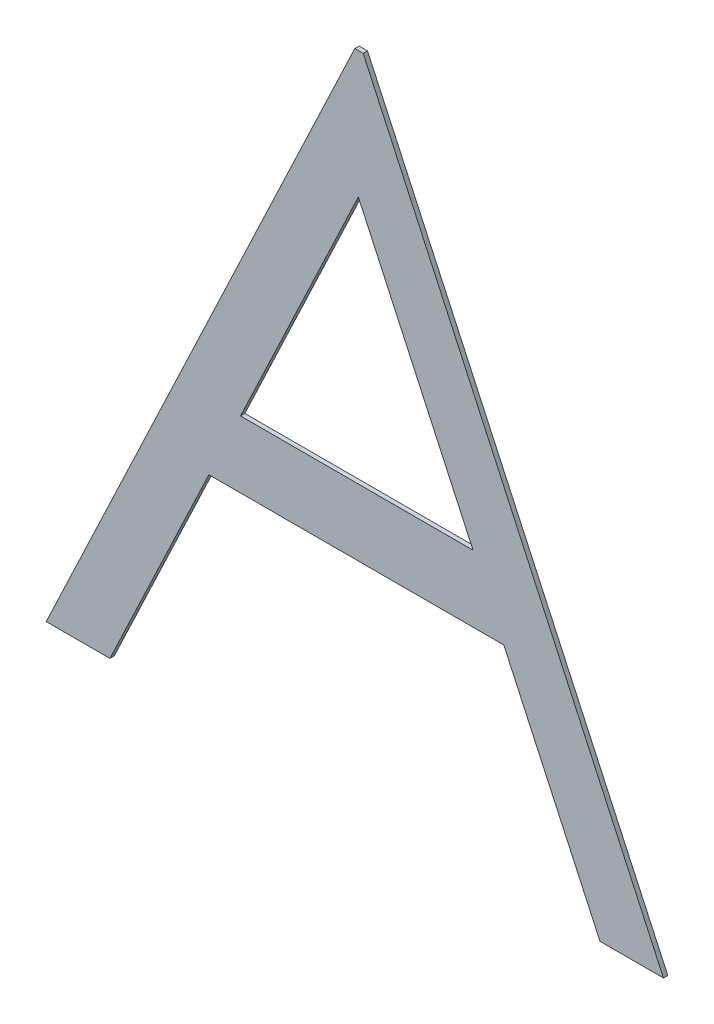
ISO-10303-21;
HEADER;
FILE_DESCRIPTION(('STEP AP214'),'2;1');
FILE_NAME('part.step','',(''),(''),'','','');
FILE_SCHEMA(('AUTOMOTIVE_DESIGN { 1 0 10303 214 1 1 1 1 }'));
ENDSEC;
DATA;
#1=APPLICATION_CONTEXT('core data for automotive mechanical design processes');
#2=APPLICATION_PROTOCOL_DEFINITION('international standard','automotive_design',2000,#1);
#3=PRODUCT_CONTEXT('',#1,'mechanical');
#4=PRODUCT('Part','Part','',(#3));
#5=PRODUCT_RELATED_PRODUCT_CATEGORY('part','',(#4));
#6=PRODUCT_DEFINITION_FORMATION('','',#4);
#7=PRODUCT_DEFINITION_CONTEXT('part definition',#1,'design');
#8=PRODUCT_DEFINITION('design','',#6,#7);
#9=PRODUCT_DEFINITION_SHAPE('','',#8);
#10=(LENGTH_UNIT() NAMED_UNIT(*) SI_UNIT(.MILLI.,.METRE.));
#11=(NAMED_UNIT(*) PLANE_ANGLE_UNIT() SI_UNIT($,.RADIAN.));
#12=(NAMED_UNIT(*) SI_UNIT($,.STERADIAN.) SOLID_ANGLE_UNIT());
#13=UNCERTAINTY_MEASURE_WITH_UNIT(LENGTH_MEASURE(1.E-05),#10,'distance_accuracy_value','');
#14=(GEOMETRIC_REPRESENTATION_CONTEXT(3) GLOBAL_UNCERTAINTY_ASSIGNED_CONTEXT((#13)) GLOBAL_UNIT_ASSIGNED_CONTEXT((#10,
#11,#12)) REPRESENTATION_CONTEXT('',''));
#15=CARTESIAN_POINT('',(0.,0.,0.));
#16=DIRECTION('',(0.,0.,1.));
#17=DIRECTION('',(1.,0.,0.));
#18=AXIS2_PLACEMENT_3D('',#15,#16,#17);
#19=CARTESIAN_POINT('',(0.,0.,0.));
#20=DIRECTION('',(0.,0.,1.));
#21=DIRECTION('',(1.,0.,0.));
#22=AXIS2_PLACEMENT_3D('',#19,#20,#21);
#23=PLANE('',#22);
#24=DIRECTION('',(0.428351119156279,0.903612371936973,0.));
#25=VECTOR('',#24,1.);
#26=CARTESIAN_POINT('',(0.136262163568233,14.4030755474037,0.));
#27=LINE('',#26,#25);
#28=CARTESIAN_POINT('',(-3.31349745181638,7.12576184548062,0.));
#29=VERTEX_POINT('',#28);
#30=CARTESIAN_POINT('',(0.136262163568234,14.4030755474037,0.));
#31=VERTEX_POINT('',#30);
#32=EDGE_CURVE('E151',#29,#31,#27,.T.);
#33=ORIENTED_EDGE('',*,*,#32,.F.);
#34=DIRECTION('',(1.,0.,0.));
#35=VECTOR('',#34,1.);
#36=CARTESIAN_POINT('',(-3.31349745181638,7.12576184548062,0.));
#37=LINE('',#36,#35);
#38=CARTESIAN_POINT('',(3.49443524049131,7.12576184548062,0.));
#39=VERTEX_POINT('',#38);
#40=EDGE_CURVE('E159',#39,#29,#37,.F.);
#41=ORIENTED_EDGE('',*,*,#40,.F.);
#42=DIRECTION('',(0.418997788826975,-0.907987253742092,0.));
#43=VECTOR('',#42,1.);
#44=CARTESIAN_POINT('',(3.49443524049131,7.12576184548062,0.));
#45=LINE('',#44,#43);
#46=EDGE_CURVE('E154',#31,#39,#45,.T.);
#47=ORIENTED_EDGE('',*,*,#46,.F.);
#48=EDGE_LOOP('',(#33,#41,#47));
#49=FACE_BOUND('',#48,.T.);
#50=DIRECTION('',(-0.419058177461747,0.907959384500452,0.));
#51=VECTOR('',#50,1.);
#52=CARTESIAN_POINT('',(0.277458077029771,18.1161464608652,0.));
#53=LINE('',#52,#51);
#54=CARTESIAN_POINT('',(9.06976576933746,-0.933853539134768,0.));
#55=VERTEX_POINT('',#54);
#56=CARTESIAN_POINT('',(0.277458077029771,18.1161464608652,0.));
#57=VERTEX_POINT('',#56);
#58=EDGE_CURVE('E145',#55,#57,#53,.T.);
#59=ORIENTED_EDGE('',*,*,#58,.F.);
#60=DIRECTION('',(1.,0.,0.));
#61=VECTOR('',#60,1.);
#62=CARTESIAN_POINT('',(9.06976576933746,-0.933853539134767,0.));
#63=LINE('',#62,#61);
#64=CARTESIAN_POINT('',(7.21132225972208,-0.933853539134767,0.));
#65=VERTEX_POINT('',#64);
#66=EDGE_CURVE('E139',#65,#55,#63,.T.);
#67=ORIENTED_EDGE('',*,*,#66,.F.);
#68=DIRECTION('',(0.418842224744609,-0.908059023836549,0.));
#69=VECTOR('',#68,1.);
#70=CARTESIAN_POINT('',(7.21132225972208,-0.933853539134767,0.));
#71=LINE('',#70,#69);
#72=CARTESIAN_POINT('',(4.39503620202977,5.17191569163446,0.));
#73=VERTEX_POINT('',#72);
#74=EDGE_CURVE('E133',#73,#65,#71,.T.);
#75=ORIENTED_EDGE('',*,*,#74,.F.);
#76=DIRECTION('',(1.,0.,0.));
#77=VECTOR('',#76,1.);
#78=CARTESIAN_POINT('',(4.39503620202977,5.17191569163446,0.));
#79=LINE('',#78,#77);
#80=CARTESIAN_POINT('',(-4.24081115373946,5.17191569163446,0.));
#81=VERTEX_POINT('',#80);
#82=EDGE_CURVE('E127',#81,#73,#79,.T.);
#83=ORIENTED_EDGE('',*,*,#82,.F.);
#84=DIRECTION('',(0.428596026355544,0.903496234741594,0.));
#85=VECTOR('',#84,1.);
#86=CARTESIAN_POINT('',(-4.24081115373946,5.17191569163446,0.));
#87=LINE('',#86,#85);
#88=CARTESIAN_POINT('',(-7.13723543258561,-0.933853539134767,0.));
#89=VERTEX_POINT('',#88);
#90=EDGE_CURVE('E121',#89,#81,#87,.T.);
#91=ORIENTED_EDGE('',*,*,#90,.F.);
#92=DIRECTION('',(1.,0.,0.));
#93=VECTOR('',#92,1.);
#94=CARTESIAN_POINT('',(-7.13723543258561,-0.933853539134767,0.));
#95=LINE('',#94,#93);
#96=CARTESIAN_POINT('',(-9.00331115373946,-0.933853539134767,0.));
#97=VERTEX_POINT('',#96);
#98=EDGE_CURVE('E97',#97,#89,#95,.T.);
#99=ORIENTED_EDGE('',*,*,#98,.F.);
#100=DIRECTION('',(-0.428584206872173,-0.903501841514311,0.));
#101=VECTOR('',#100,1.);
#102=CARTESIAN_POINT('',(-9.00331115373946,-0.933853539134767,0.));
#103=LINE('',#102,#101);
#104=CARTESIAN_POINT('',(0.0332273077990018,18.1161464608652,0.));
#105=VERTEX_POINT('',#104);
#106=EDGE_CURVE('E99',#105,#97,#103,.T.);
#107=ORIENTED_EDGE('',*,*,#106,.F.);
#108=DIRECTION('',(1.,0.,0.));
#109=VECTOR('',#108,1.);
#110=CARTESIAN_POINT('',(0.0332273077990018,18.1161464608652,0.));
#111=LINE('',#110,#109);
#112=EDGE_CURVE('E19',#57,#105,#111,.F.);
#113=ORIENTED_EDGE('',*,*,#112,.F.);
#114=EDGE_LOOP('',(#59,#67,#75,#83,#91,#99,#107,#113));
#115=FACE_BOUND('',#114,.T.);
#116=ADVANCED_FACE('F16',(#49,#115),#23,.F.);
#117=CARTESIAN_POINT('',(0.0332273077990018,18.1161464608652,0.127));
#118=DIRECTION('',(0.,1.,0.));
#119=DIRECTION('',(0.,0.,1.));
#120=AXIS2_PLACEMENT_3D('',#117,#118,#119);
#121=PLANE('',#120);
#122=DIRECTION('',(1.,0.,0.));
#123=VECTOR('',#122,1.);
#124=CARTESIAN_POINT('',(0.,18.1161464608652,0.127));
#125=LINE('',#124,#123);
#126=CARTESIAN_POINT('',(0.277458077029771,18.1161464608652,0.127));
#127=VERTEX_POINT('',#126);
#128=CARTESIAN_POINT('',(0.0332273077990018,18.1161464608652,0.127));
#129=VERTEX_POINT('',#128);
#130=EDGE_CURVE('E166',#127,#129,#125,.F.);
#131=ORIENTED_EDGE('',*,*,#130,.F.);
#132=DIRECTION('',(0.,0.,1.));
#133=VECTOR('',#132,1.);
#134=CARTESIAN_POINT('',(0.277458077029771,18.1161464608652,0.127));
#135=LINE('',#134,#133);
#136=EDGE_CURVE('E110',#57,#127,#135,.T.);
#137=ORIENTED_EDGE('',*,*,#136,.F.);
#138=ORIENTED_EDGE('',*,*,#112,.T.);
#139=DIRECTION('',(0.,0.,1.));
#140=VECTOR('',#139,1.);
#141=CARTESIAN_POINT('',(0.0332273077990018,18.1161464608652,0.127));
#142=LINE('',#141,#140);
#143=EDGE_CURVE('E105',#129,#105,#142,.F.);
#144=ORIENTED_EDGE('',*,*,#143,.F.);
#145=EDGE_LOOP('',(#131,#137,#138,#144));
#146=FACE_BOUND('',#145,.T.);
#147=ADVANCED_FACE('F107',(#146),#121,.T.);
#148=CARTESIAN_POINT('',(-9.00331115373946,-0.933853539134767,0.127));
#149=DIRECTION('',(-0.903501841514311,0.428584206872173,0.));
#150=DIRECTION('',(-0.428584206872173,-0.903501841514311,0.));
#151=AXIS2_PLACEMENT_3D('',#148,#149,#150);
#152=PLANE('',#151);
#153=DIRECTION('',(-0.428584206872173,-0.90350184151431,0.));
#154=VECTOR('',#153,1.);
#155=CARTESIAN_POINT('',(0.0332273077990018,18.1161464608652,0.127));
#156=LINE('',#155,#154);
#157=CARTESIAN_POINT('',(-9.00331115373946,-0.933853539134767,0.127));
#158=VERTEX_POINT('',#157);
#159=EDGE_CURVE('E114',#129,#158,#156,.T.);
#160=ORIENTED_EDGE('',*,*,#159,.F.);
#161=ORIENTED_EDGE('',*,*,#143,.T.);
#162=ORIENTED_EDGE('',*,*,#106,.T.);
#163=DIRECTION('',(0.,0.,-1.));
#164=VECTOR('',#163,1.);
#165=CARTESIAN_POINT('',(-9.00331115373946,-0.933853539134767,0.127));
#166=LINE('',#165,#164);
#167=EDGE_CURVE('E117',#158,#97,#166,.T.);
#168=ORIENTED_EDGE('',*,*,#167,.F.);
#169=EDGE_LOOP('',(#160,#161,#162,#168));
#170=FACE_BOUND('',#169,.T.);
#171=ADVANCED_FACE('F112',(#170),#152,.T.);
#172=CARTESIAN_POINT('',(-7.13723543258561,-0.933853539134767,0.127));
#173=DIRECTION('',(0.,-1.,0.));
#174=DIRECTION('',(0.,0.,-1.));
#175=AXIS2_PLACEMENT_3D('',#172,#173,#174);
#176=PLANE('',#175);
#177=DIRECTION('',(1.,0.,0.));
#178=VECTOR('',#177,1.);
#179=CARTESIAN_POINT('',(0.,-0.933853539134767,0.127));
#180=LINE('',#179,#178);
#181=CARTESIAN_POINT('',(-7.13723543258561,-0.933853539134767,0.127));
#182=VERTEX_POINT('',#181);
#183=EDGE_CURVE('E169',#158,#182,#180,.T.);
#184=ORIENTED_EDGE('',*,*,#183,.F.);
#185=ORIENTED_EDGE('',*,*,#167,.T.);
#186=ORIENTED_EDGE('',*,*,#98,.T.);
#187=DIRECTION('',(0.,0.,1.));
#188=VECTOR('',#187,1.);
#189=CARTESIAN_POINT('',(-7.13723543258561,-0.933853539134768,0.127));
#190=LINE('',#189,#188);
#191=EDGE_CURVE('E124',#182,#89,#190,.F.);
#192=ORIENTED_EDGE('',*,*,#191,.F.);
#193=EDGE_LOOP('',(#184,#185,#186,#192));
#194=FACE_BOUND('',#193,.T.);
#195=ADVANCED_FACE('F232',(#194),#176,.T.);
#196=CARTESIAN_POINT('',(-4.24081115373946,5.17191569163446,0.127));
#197=DIRECTION('',(0.903496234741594,-0.428596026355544,0.));
#198=DIRECTION('',(0.428596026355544,0.903496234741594,0.));
#199=AXIS2_PLACEMENT_3D('',#196,#197,#198);
#200=PLANE('',#199);
#201=DIRECTION('',(0.428596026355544,0.903496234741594,0.));
#202=VECTOR('',#201,1.);
#203=CARTESIAN_POINT('',(-7.13723543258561,-0.933853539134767,0.127));
#204=LINE('',#203,#202);
#205=CARTESIAN_POINT('',(-4.24081115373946,5.17191569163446,0.127));
#206=VERTEX_POINT('',#205);
#207=EDGE_CURVE('E172',#182,#206,#204,.T.);
#208=ORIENTED_EDGE('',*,*,#207,.F.);
#209=ORIENTED_EDGE('',*,*,#191,.T.);
#210=ORIENTED_EDGE('',*,*,#90,.T.);
#211=DIRECTION('',(0.,0.,-1.));
#212=VECTOR('',#211,1.);
#213=CARTESIAN_POINT('',(-4.24081115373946,5.17191569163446,0.127));
#214=LINE('',#213,#212);
#215=EDGE_CURVE('E130',#206,#81,#214,.T.);
#216=ORIENTED_EDGE('',*,*,#215,.F.);
#217=EDGE_LOOP('',(#208,#209,#210,#216));
#218=FACE_BOUND('',#217,.T.);
#219=ADVANCED_FACE('F228',(#218),#200,.T.);
#220=CARTESIAN_POINT('',(4.39503620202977,5.17191569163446,0.127));
#221=DIRECTION('',(0.,-1.,0.));
#222=DIRECTION('',(0.,0.,-1.));
#223=AXIS2_PLACEMENT_3D('',#220,#221,#222);
#224=PLANE('',#223);
#225=DIRECTION('',(1.,0.,0.));
#226=VECTOR('',#225,1.);
#227=CARTESIAN_POINT('',(0.,5.17191569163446,0.127));
#228=LINE('',#227,#226);
#229=CARTESIAN_POINT('',(4.39503620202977,5.17191569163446,0.127));
#230=VERTEX_POINT('',#229);
#231=EDGE_CURVE('E175',#206,#230,#228,.T.);
#232=ORIENTED_EDGE('',*,*,#231,.F.);
#233=ORIENTED_EDGE('',*,*,#215,.T.);
#234=ORIENTED_EDGE('',*,*,#82,.T.);
#235=DIRECTION('',(0.,0.,1.));
#236=VECTOR('',#235,1.);
#237=CARTESIAN_POINT('',(4.39503620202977,5.17191569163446,0.127));
#238=LINE('',#237,#236);
#239=EDGE_CURVE('E136',#230,#73,#238,.F.);
#240=ORIENTED_EDGE('',*,*,#239,.F.);
#241=EDGE_LOOP('',(#232,#233,#234,#240));
#242=FACE_BOUND('',#241,.T.);
#243=ADVANCED_FACE('F224',(#242),#224,.T.);
#244=CARTESIAN_POINT('',(7.21132225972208,-0.933853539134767,0.127));
#245=DIRECTION('',(-0.908059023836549,-0.418842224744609,0.));
#246=DIRECTION('',(0.418842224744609,-0.908059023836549,0.));
#247=AXIS2_PLACEMENT_3D('',#244,#245,#246);
#248=PLANE('',#247);
#249=DIRECTION('',(0.418842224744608,-0.908059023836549,0.));
#250=VECTOR('',#249,1.);
#251=CARTESIAN_POINT('',(4.39503620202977,5.17191569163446,0.127));
#252=LINE('',#251,#250);
#253=CARTESIAN_POINT('',(7.21132225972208,-0.933853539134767,0.127));
#254=VERTEX_POINT('',#253);
#255=EDGE_CURVE('E178',#230,#254,#252,.T.);
#256=ORIENTED_EDGE('',*,*,#255,.F.);
#257=ORIENTED_EDGE('',*,*,#239,.T.);
#258=ORIENTED_EDGE('',*,*,#74,.T.);
#259=DIRECTION('',(0.,0.,-1.));
#260=VECTOR('',#259,1.);
#261=CARTESIAN_POINT('',(7.21132225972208,-0.933853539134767,0.127));
#262=LINE('',#261,#260);
#263=EDGE_CURVE('E142',#254,#65,#262,.T.);
#264=ORIENTED_EDGE('',*,*,#263,.F.);
#265=EDGE_LOOP('',(#256,#257,#258,#264));
#266=FACE_BOUND('',#265,.T.);
#267=ADVANCED_FACE('F220',(#266),#248,.T.);
#268=CARTESIAN_POINT('',(9.06976576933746,-0.933853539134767,0.127));
#269=DIRECTION('',(0.,-1.,0.));
#270=DIRECTION('',(0.,0.,-1.));
#271=AXIS2_PLACEMENT_3D('',#268,#269,#270);
#272=PLANE('',#271);
#273=DIRECTION('',(1.,0.,0.));
#274=VECTOR('',#273,1.);
#275=CARTESIAN_POINT('',(0.,-0.933853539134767,0.127));
#276=LINE('',#275,#274);
#277=CARTESIAN_POINT('',(9.06976576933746,-0.933853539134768,0.127));
#278=VERTEX_POINT('',#277);
#279=EDGE_CURVE('E181',#254,#278,#276,.T.);
#280=ORIENTED_EDGE('',*,*,#279,.F.);
#281=ORIENTED_EDGE('',*,*,#263,.T.);
#282=ORIENTED_EDGE('',*,*,#66,.T.);
#283=DIRECTION('',(0.,0.,1.));
#284=VECTOR('',#283,1.);
#285=CARTESIAN_POINT('',(9.06976576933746,-0.93385353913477,0.127));
#286=LINE('',#285,#284);
#287=EDGE_CURVE('E148',#278,#55,#286,.F.);
#288=ORIENTED_EDGE('',*,*,#287,.F.);
#289=EDGE_LOOP('',(#280,#281,#282,#288));
#290=FACE_BOUND('',#289,.T.);
#291=ADVANCED_FACE('F216',(#290),#272,.T.);
#292=CARTESIAN_POINT('',(0.277458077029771,18.1161464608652,0.127));
#293=DIRECTION('',(0.907959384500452,0.419058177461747,0.));
#294=DIRECTION('',(-0.419058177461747,0.907959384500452,0.));
#295=AXIS2_PLACEMENT_3D('',#292,#293,#294);
#296=PLANE('',#295);
#297=DIRECTION('',(-0.419058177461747,0.907959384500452,0.));
#298=VECTOR('',#297,1.);
#299=CARTESIAN_POINT('',(9.06976576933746,-0.933853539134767,0.127));
#300=LINE('',#299,#298);
#301=EDGE_CURVE('E184',#278,#127,#300,.T.);
#302=ORIENTED_EDGE('',*,*,#301,.F.);
#303=ORIENTED_EDGE('',*,*,#287,.T.);
#304=ORIENTED_EDGE('',*,*,#58,.T.);
#305=ORIENTED_EDGE('',*,*,#136,.T.);
#306=EDGE_LOOP('',(#302,#303,#304,#305));
#307=FACE_BOUND('',#306,.T.);
#308=ADVANCED_FACE('F213',(#307),#296,.T.);
#309=CARTESIAN_POINT('',(0.136262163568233,14.4030755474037,0.127));
#310=DIRECTION('',(0.903612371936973,-0.428351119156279,0.));
#311=DIRECTION('',(0.428351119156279,0.903612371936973,0.));
#312=AXIS2_PLACEMENT_3D('',#309,#310,#311);
#313=PLANE('',#312);
#314=DIRECTION('',(0.428351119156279,0.903612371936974,0.));
#315=VECTOR('',#314,1.);
#316=CARTESIAN_POINT('',(-3.31349745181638,7.12576184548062,0.127));
#317=LINE('',#316,#315);
#318=CARTESIAN_POINT('',(-3.31349745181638,7.12576184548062,0.127));
#319=VERTEX_POINT('',#318);
#320=CARTESIAN_POINT('',(0.136262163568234,14.4030755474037,0.127));
#321=VERTEX_POINT('',#320);
#322=EDGE_CURVE('E187',#319,#321,#317,.T.);
#323=ORIENTED_EDGE('',*,*,#322,.F.);
#324=DIRECTION('',(0.,0.,1.));
#325=VECTOR('',#324,1.);
#326=CARTESIAN_POINT('',(-3.31349745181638,7.12576184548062,0.127));
#327=LINE('',#326,#325);
#328=EDGE_CURVE('E162',#29,#319,#327,.T.);
#329=ORIENTED_EDGE('',*,*,#328,.F.);
#330=ORIENTED_EDGE('',*,*,#32,.T.);
#331=DIRECTION('',(0.,0.,1.));
#332=VECTOR('',#331,1.);
#333=CARTESIAN_POINT('',(0.136262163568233,14.4030755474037,0.127));
#334=LINE('',#333,#332);
#335=EDGE_CURVE('E156',#321,#31,#334,.F.);
#336=ORIENTED_EDGE('',*,*,#335,.F.);
#337=EDGE_LOOP('',(#323,#329,#330,#336));
#338=FACE_BOUND('',#337,.T.);
#339=ADVANCED_FACE('F196',(#338),#313,.T.);
#340=CARTESIAN_POINT('',(3.49443524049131,7.12576184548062,0.127));
#341=DIRECTION('',(-0.907987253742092,-0.418997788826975,0.));
#342=DIRECTION('',(0.418997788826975,-0.907987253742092,0.));
#343=AXIS2_PLACEMENT_3D('',#340,#341,#342);
#344=PLANE('',#343);
#345=DIRECTION('',(0.418997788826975,-0.907987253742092,0.));
#346=VECTOR('',#345,1.);
#347=CARTESIAN_POINT('',(0.136262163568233,14.4030755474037,0.127));
#348=LINE('',#347,#346);
#349=CARTESIAN_POINT('',(3.49443524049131,7.12576184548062,0.127));
#350=VERTEX_POINT('',#349);
#351=EDGE_CURVE('E25',#321,#350,#348,.T.);
#352=ORIENTED_EDGE('',*,*,#351,.F.);
#353=ORIENTED_EDGE('',*,*,#335,.T.);
#354=ORIENTED_EDGE('',*,*,#46,.T.);
#355=DIRECTION('',(0.,0.,1.));
#356=VECTOR('',#355,1.);
#357=CARTESIAN_POINT('',(3.49443524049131,7.12576184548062,0.127));
#358=LINE('',#357,#356);
#359=EDGE_CURVE('E34',#350,#39,#358,.F.);
#360=ORIENTED_EDGE('',*,*,#359,.F.);
#361=EDGE_LOOP('',(#352,#353,#354,#360));
#362=FACE_BOUND('',#361,.T.);
#363=ADVANCED_FACE('F194',(#362),#344,.T.);
#364=CARTESIAN_POINT('',(-3.31349745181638,7.12576184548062,0.127));
#365=DIRECTION('',(0.,1.,0.));
#366=DIRECTION('',(0.,0.,1.));
#367=AXIS2_PLACEMENT_3D('',#364,#365,#366);
#368=PLANE('',#367);
#369=DIRECTION('',(1.,0.,0.));
#370=VECTOR('',#369,1.);
#371=CARTESIAN_POINT('',(0.,7.12576184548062,0.127));
#372=LINE('',#371,#370);
#373=EDGE_CURVE('E11',#350,#319,#372,.F.);
#374=ORIENTED_EDGE('',*,*,#373,.F.);
#375=ORIENTED_EDGE('',*,*,#359,.T.);
#376=ORIENTED_EDGE('',*,*,#40,.T.);
#377=ORIENTED_EDGE('',*,*,#328,.T.);
#378=EDGE_LOOP('',(#374,#375,#376,#377));
#379=FACE_BOUND('',#378,.T.);
#380=ADVANCED_FACE('F200',(#379),#368,.T.);
#381=CARTESIAN_POINT('',(0.,0.,0.127));
#382=DIRECTION('',(0.,0.,1.));
#383=DIRECTION('',(1.,0.,0.));
#384=AXIS2_PLACEMENT_3D('',#381,#382,#383);
#385=PLANE('',#384);
#386=ORIENTED_EDGE('',*,*,#351,.T.);
#387=ORIENTED_EDGE('',*,*,#373,.T.);
#388=ORIENTED_EDGE('',*,*,#322,.T.);
#389=EDGE_LOOP('',(#386,#387,#388));
#390=FACE_BOUND('',#389,.T.);
#391=ORIENTED_EDGE('',*,*,#279,.T.);
#392=ORIENTED_EDGE('',*,*,#301,.T.);
#393=ORIENTED_EDGE('',*,*,#130,.T.);
#394=ORIENTED_EDGE('',*,*,#159,.T.);
#395=ORIENTED_EDGE('',*,*,#183,.T.);
#396=ORIENTED_EDGE('',*,*,#207,.T.);
#397=ORIENTED_EDGE('',*,*,#231,.T.);
#398=ORIENTED_EDGE('',*,*,#255,.T.);
#399=EDGE_LOOP('',(#391,#392,#393,#394,#395,#396,#397,#398));
#400=FACE_BOUND('',#399,.T.);
#401=ADVANCED_FACE('F192',(#390,#400),#385,.T.);
#402=CLOSED_SHELL('',(#116,#147,#171,#195,#219,#243,#267,#291,#308,#339,#363,#380,#401));
#403=MANIFOLD_SOLID_BREP('B1',#402);
#404=ADVANCED_BREP_SHAPE_REPRESENTATION('',(#18,#403),#14);
#405=SHAPE_DEFINITION_REPRESENTATION(#9,#404);
ENDSEC;
END-ISO-10303-21;
